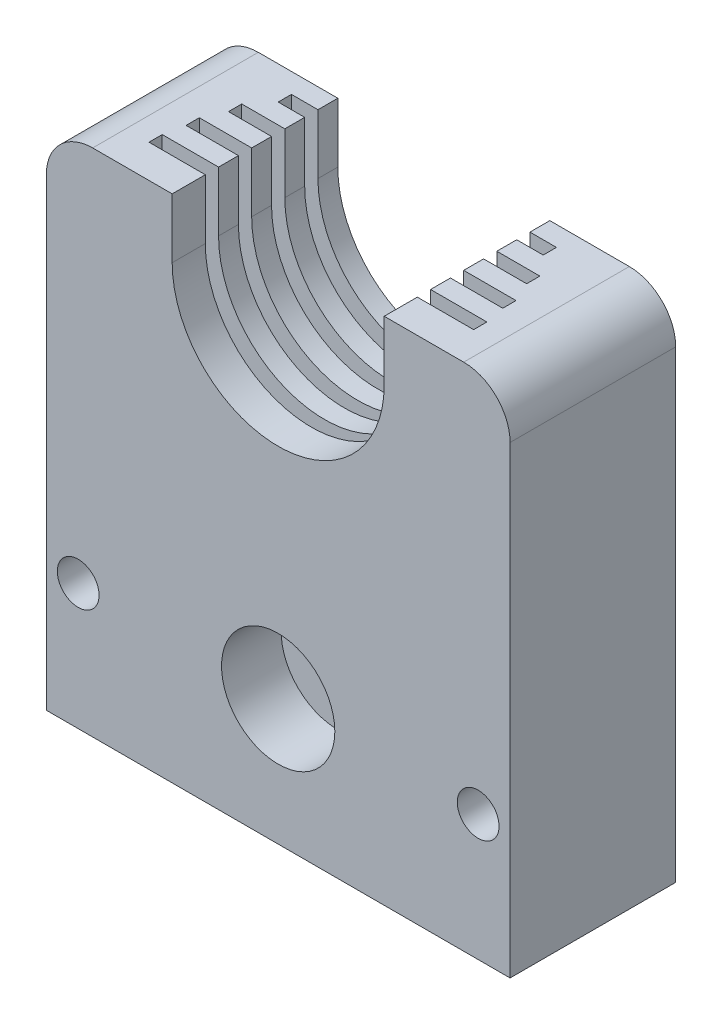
ISO-10303-21;
HEADER;
FILE_DESCRIPTION(('STEP AP214'),'2;1');
FILE_NAME('part.step','',(''),(''),'','','');
FILE_SCHEMA(('AUTOMOTIVE_DESIGN { 1 0 10303 214 1 1 1 1 }'));
ENDSEC;
DATA;
#1=APPLICATION_CONTEXT('core data for automotive mechanical design processes');
#2=APPLICATION_PROTOCOL_DEFINITION('international standard','automotive_design',2000,#1);
#3=PRODUCT_CONTEXT('',#1,'mechanical');
#4=PRODUCT('Part','Part','',(#3));
#5=PRODUCT_RELATED_PRODUCT_CATEGORY('part','',(#4));
#6=PRODUCT_DEFINITION_FORMATION('','',#4);
#7=PRODUCT_DEFINITION_CONTEXT('part definition',#1,'design');
#8=PRODUCT_DEFINITION('design','',#6,#7);
#9=PRODUCT_DEFINITION_SHAPE('','',#8);
#10=(LENGTH_UNIT() NAMED_UNIT(*) SI_UNIT(.MILLI.,.METRE.));
#11=(NAMED_UNIT(*) PLANE_ANGLE_UNIT() SI_UNIT($,.RADIAN.));
#12=(NAMED_UNIT(*) SI_UNIT($,.STERADIAN.) SOLID_ANGLE_UNIT());
#13=UNCERTAINTY_MEASURE_WITH_UNIT(LENGTH_MEASURE(1.E-05),#10,'distance_accuracy_value','');
#14=(GEOMETRIC_REPRESENTATION_CONTEXT(3) GLOBAL_UNCERTAINTY_ASSIGNED_CONTEXT((#13)) GLOBAL_UNIT_ASSIGNED_CONTEXT((#10,
#11,#12)) REPRESENTATION_CONTEXT('',''));
#15=CARTESIAN_POINT('',(0.,0.,0.));
#16=DIRECTION('',(0.,0.,1.));
#17=DIRECTION('',(1.,0.,0.));
#18=AXIS2_PLACEMENT_3D('',#15,#16,#17);
#19=CARTESIAN_POINT('',(0.,70.,25.));
#20=DIRECTION('',(0.,-1.,0.));
#21=DIRECTION('',(0.,0.,-1.));
#22=AXIS2_PLACEMENT_3D('',#19,#20,#21);
#23=PLANE('',#22);
#24=DIRECTION('',(0.,0.,-1.));
#25=VECTOR('',#24,1.);
#26=CARTESIAN_POINT('',(59.5,70.,0.));
#27=LINE('',#26,#25);
#28=CARTESIAN_POINT('',(59.5,70.,20.));
#29=VERTEX_POINT('',#28);
#30=CARTESIAN_POINT('',(59.5,70.,18.));
#31=VERTEX_POINT('',#30);
#32=EDGE_CURVE('E363',#29,#31,#27,.T.);
#33=ORIENTED_EDGE('',*,*,#32,.F.);
#34=DIRECTION('',(1.,0.,0.));
#35=VECTOR('',#34,1.);
#36=CARTESIAN_POINT('',(0.,70.,20.));
#37=LINE('',#36,#35);
#38=CARTESIAN_POINT('',(51.,70.,20.));
#39=VERTEX_POINT('',#38);
#40=EDGE_CURVE('E336',#39,#29,#37,.T.);
#41=ORIENTED_EDGE('',*,*,#40,.F.);
#42=DIRECTION('',(0.,0.,-1.));
#43=VECTOR('',#42,1.);
#44=CARTESIAN_POINT('',(51.,70.,152.628611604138));
#45=LINE('',#44,#43);
#46=CARTESIAN_POINT('',(51.,70.,25.));
#47=VERTEX_POINT('',#46);
#48=EDGE_CURVE('E554',#47,#39,#45,.T.);
#49=ORIENTED_EDGE('',*,*,#48,.F.);
#50=DIRECTION('',(-1.,0.,0.));
#51=VECTOR('',#50,1.);
#52=CARTESIAN_POINT('',(0.,70.,25.));
#53=LINE('',#52,#51);
#54=CARTESIAN_POINT('',(63.,70.,25.));
#55=VERTEX_POINT('',#54);
#56=EDGE_CURVE('E572',#55,#47,#53,.T.);
#57=ORIENTED_EDGE('',*,*,#56,.F.);
#58=DIRECTION('',(0.,0.,-1.));
#59=VECTOR('',#58,1.);
#60=CARTESIAN_POINT('',(63.,70.,25.));
#61=LINE('',#60,#59);
#62=CARTESIAN_POINT('',(63.,70.,0.));
#63=VERTEX_POINT('',#62);
#64=EDGE_CURVE('E575',#55,#63,#61,.T.);
#65=ORIENTED_EDGE('',*,*,#64,.T.);
#66=DIRECTION('',(-1.,0.,0.));
#67=VECTOR('',#66,1.);
#68=CARTESIAN_POINT('',(0.,70.,0.));
#69=LINE('',#68,#67);
#70=CARTESIAN_POINT('',(51.,70.,0.));
#71=VERTEX_POINT('',#70);
#72=EDGE_CURVE('E568',#63,#71,#69,.T.);
#73=ORIENTED_EDGE('',*,*,#72,.T.);
#74=CARTESIAN_POINT('',(51.,70.,3.));
#75=VERTEX_POINT('',#74);
#76=EDGE_CURVE('E552',#75,#71,#45,.T.);
#77=ORIENTED_EDGE('',*,*,#76,.F.);
#78=DIRECTION('',(1.,0.,0.));
#79=VECTOR('',#78,1.);
#80=CARTESIAN_POINT('',(15.,70.,3.));
#81=LINE('',#80,#79);
#82=CARTESIAN_POINT('',(55.,70.,3.));
#83=VERTEX_POINT('',#82);
#84=EDGE_CURVE('E454',#75,#83,#81,.T.);
#85=ORIENTED_EDGE('',*,*,#84,.T.);
#86=DIRECTION('',(0.,0.,-1.));
#87=VECTOR('',#86,1.);
#88=CARTESIAN_POINT('',(55.,70.,5.));
#89=LINE('',#88,#87);
#90=CARTESIAN_POINT('',(55.,70.,5.));
#91=VERTEX_POINT('',#90);
#92=EDGE_CURVE('E450',#91,#83,#89,.T.);
#93=ORIENTED_EDGE('',*,*,#92,.F.);
#94=DIRECTION('',(1.,0.,0.));
#95=VECTOR('',#94,1.);
#96=CARTESIAN_POINT('',(15.,70.,5.));
#97=LINE('',#96,#95);
#98=CARTESIAN_POINT('',(51.,70.,5.));
#99=VERTEX_POINT('',#98);
#100=EDGE_CURVE('E451',#99,#91,#97,.T.);
#101=ORIENTED_EDGE('',*,*,#100,.F.);
#102=CARTESIAN_POINT('',(51.,70.,8.));
#103=VERTEX_POINT('',#102);
#104=EDGE_CURVE('E729',#103,#99,#45,.T.);
#105=ORIENTED_EDGE('',*,*,#104,.F.);
#106=DIRECTION('',(1.,0.,0.));
#107=VECTOR('',#106,1.);
#108=CARTESIAN_POINT('',(0.,70.,8.));
#109=LINE('',#108,#107);
#110=CARTESIAN_POINT('',(57.5,70.,8.));
#111=VERTEX_POINT('',#110);
#112=EDGE_CURVE('E420',#103,#111,#109,.T.);
#113=ORIENTED_EDGE('',*,*,#112,.T.);
#114=DIRECTION('',(0.,0.,-1.));
#115=VECTOR('',#114,1.);
#116=CARTESIAN_POINT('',(57.5,70.,0.));
#117=LINE('',#116,#115);
#118=CARTESIAN_POINT('',(57.5,70.,10.));
#119=VERTEX_POINT('',#118);
#120=EDGE_CURVE('E425',#119,#111,#117,.T.);
#121=ORIENTED_EDGE('',*,*,#120,.F.);
#122=DIRECTION('',(1.,0.,0.));
#123=VECTOR('',#122,1.);
#124=CARTESIAN_POINT('',(0.,70.,10.));
#125=LINE('',#124,#123);
#126=CARTESIAN_POINT('',(51.,70.,10.));
#127=VERTEX_POINT('',#126);
#128=EDGE_CURVE('E428',#127,#119,#125,.T.);
#129=ORIENTED_EDGE('',*,*,#128,.F.);
#130=CARTESIAN_POINT('',(51.,70.,13.));
#131=VERTEX_POINT('',#130);
#132=EDGE_CURVE('E829',#131,#127,#45,.T.);
#133=ORIENTED_EDGE('',*,*,#132,.F.);
#134=DIRECTION('',(1.,0.,0.));
#135=VECTOR('',#134,1.);
#136=CARTESIAN_POINT('',(0.,70.,13.));
#137=LINE('',#136,#135);
#138=CARTESIAN_POINT('',(58.9,70.,13.));
#139=VERTEX_POINT('',#138);
#140=EDGE_CURVE('E394',#131,#139,#137,.T.);
#141=ORIENTED_EDGE('',*,*,#140,.T.);
#142=DIRECTION('',(0.,0.,-1.));
#143=VECTOR('',#142,1.);
#144=CARTESIAN_POINT('',(58.9,70.,0.));
#145=LINE('',#144,#143);
#146=CARTESIAN_POINT('',(58.9,70.,15.));
#147=VERTEX_POINT('',#146);
#148=EDGE_CURVE('E385',#147,#139,#145,.T.);
#149=ORIENTED_EDGE('',*,*,#148,.F.);
#150=DIRECTION('',(1.,0.,0.));
#151=VECTOR('',#150,1.);
#152=CARTESIAN_POINT('',(0.,70.,15.));
#153=LINE('',#152,#151);
#154=CARTESIAN_POINT('',(51.,70.,15.));
#155=VERTEX_POINT('',#154);
#156=EDGE_CURVE('E388',#155,#147,#153,.T.);
#157=ORIENTED_EDGE('',*,*,#156,.F.);
#158=CARTESIAN_POINT('',(51.,70.,18.));
#159=VERTEX_POINT('',#158);
#160=EDGE_CURVE('E558',#159,#155,#45,.T.);
#161=ORIENTED_EDGE('',*,*,#160,.F.);
#162=DIRECTION('',(1.,0.,0.));
#163=VECTOR('',#162,1.);
#164=CARTESIAN_POINT('',(0.,70.,18.));
#165=LINE('',#164,#163);
#166=EDGE_CURVE('E365',#159,#31,#165,.T.);
#167=ORIENTED_EDGE('',*,*,#166,.T.);
#168=EDGE_LOOP('',(#33,#41,#49,#57,#65,#73,#77,#85,#93,#101,#105,#113,#121,#129,#133,#141,#149,
#157,#161,#167));
#169=FACE_BOUND('',#168,.T.);
#170=ADVANCED_FACE('F62',(#169),#23,.F.);
#171=DIRECTION('',(0.,0.,-1.));
#172=VECTOR('',#171,1.);
#173=CARTESIAN_POINT('',(19.,70.,152.628611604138));
#174=LINE('',#173,#172);
#175=CARTESIAN_POINT('',(19.,70.,25.));
#176=VERTEX_POINT('',#175);
#177=CARTESIAN_POINT('',(19.,70.,20.));
#178=VERTEX_POINT('',#177);
#179=EDGE_CURVE('E539',#176,#178,#174,.T.);
#180=ORIENTED_EDGE('',*,*,#179,.T.);
#181=CARTESIAN_POINT('',(10.5,70.,20.));
#182=VERTEX_POINT('',#181);
#183=EDGE_CURVE('E361',#182,#178,#37,.T.);
#184=ORIENTED_EDGE('',*,*,#183,.F.);
#185=DIRECTION('',(0.,0.,-1.));
#186=VECTOR('',#185,1.);
#187=CARTESIAN_POINT('',(10.5,70.,0.));
#188=LINE('',#187,#186);
#189=CARTESIAN_POINT('',(10.5,70.,18.));
#190=VERTEX_POINT('',#189);
#191=EDGE_CURVE('E353',#182,#190,#188,.T.);
#192=ORIENTED_EDGE('',*,*,#191,.T.);
#193=CARTESIAN_POINT('',(19.,70.,18.));
#194=VERTEX_POINT('',#193);
#195=EDGE_CURVE('E356',#190,#194,#165,.T.);
#196=ORIENTED_EDGE('',*,*,#195,.T.);
#197=CARTESIAN_POINT('',(19.,70.,15.));
#198=VERTEX_POINT('',#197);
#199=EDGE_CURVE('E543',#194,#198,#174,.T.);
#200=ORIENTED_EDGE('',*,*,#199,.T.);
#201=CARTESIAN_POINT('',(11.1,70.,15.));
#202=VERTEX_POINT('',#201);
#203=EDGE_CURVE('E85',#202,#198,#153,.T.);
#204=ORIENTED_EDGE('',*,*,#203,.F.);
#205=DIRECTION('',(0.,0.,-1.));
#206=VECTOR('',#205,1.);
#207=CARTESIAN_POINT('',(11.1,70.,0.));
#208=LINE('',#207,#206);
#209=CARTESIAN_POINT('',(11.1,70.,13.));
#210=VERTEX_POINT('',#209);
#211=EDGE_CURVE('E391',#202,#210,#208,.T.);
#212=ORIENTED_EDGE('',*,*,#211,.T.);
#213=CARTESIAN_POINT('',(19.,70.,13.));
#214=VERTEX_POINT('',#213);
#215=EDGE_CURVE('E395',#210,#214,#137,.T.);
#216=ORIENTED_EDGE('',*,*,#215,.T.);
#217=CARTESIAN_POINT('',(19.,70.,10.));
#218=VERTEX_POINT('',#217);
#219=EDGE_CURVE('E704',#214,#218,#174,.T.);
#220=ORIENTED_EDGE('',*,*,#219,.T.);
#221=CARTESIAN_POINT('',(12.5,70.,10.));
#222=VERTEX_POINT('',#221);
#223=EDGE_CURVE('E384',#222,#218,#125,.T.);
#224=ORIENTED_EDGE('',*,*,#223,.F.);
#225=DIRECTION('',(0.,0.,-1.));
#226=VECTOR('',#225,1.);
#227=CARTESIAN_POINT('',(12.5,70.,0.));
#228=LINE('',#227,#226);
#229=CARTESIAN_POINT('',(12.5,70.,8.));
#230=VERTEX_POINT('',#229);
#231=EDGE_CURVE('E417',#222,#230,#228,.T.);
#232=ORIENTED_EDGE('',*,*,#231,.T.);
#233=CARTESIAN_POINT('',(19.,70.,8.));
#234=VERTEX_POINT('',#233);
#235=EDGE_CURVE('E422',#230,#234,#109,.T.);
#236=ORIENTED_EDGE('',*,*,#235,.T.);
#237=CARTESIAN_POINT('',(19.,70.,5.));
#238=VERTEX_POINT('',#237);
#239=EDGE_CURVE('E705',#234,#238,#174,.T.);
#240=ORIENTED_EDGE('',*,*,#239,.T.);
#241=CARTESIAN_POINT('',(15.,70.,5.));
#242=VERTEX_POINT('',#241);
#243=EDGE_CURVE('E77',#242,#238,#97,.T.);
#244=ORIENTED_EDGE('',*,*,#243,.F.);
#245=DIRECTION('',(0.,0.,-1.));
#246=VECTOR('',#245,1.);
#247=CARTESIAN_POINT('',(15.,70.,5.));
#248=LINE('',#247,#246);
#249=CARTESIAN_POINT('',(15.,70.,3.));
#250=VERTEX_POINT('',#249);
#251=EDGE_CURVE('E416',#242,#250,#248,.T.);
#252=ORIENTED_EDGE('',*,*,#251,.T.);
#253=CARTESIAN_POINT('',(19.,70.,3.));
#254=VERTEX_POINT('',#253);
#255=EDGE_CURVE('E455',#250,#254,#81,.T.);
#256=ORIENTED_EDGE('',*,*,#255,.T.);
#257=CARTESIAN_POINT('',(19.,70.,0.));
#258=VERTEX_POINT('',#257);
#259=EDGE_CURVE('E530',#254,#258,#174,.T.);
#260=ORIENTED_EDGE('',*,*,#259,.T.);
#261=CARTESIAN_POINT('',(6.99999999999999,70.,0.));
#262=VERTEX_POINT('',#261);
#263=EDGE_CURVE('E580',#258,#262,#69,.T.);
#264=ORIENTED_EDGE('',*,*,#263,.T.);
#265=DIRECTION('',(0.,0.,-1.));
#266=VECTOR('',#265,1.);
#267=CARTESIAN_POINT('',(6.99999999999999,70.,25.));
#268=LINE('',#267,#266);
#269=CARTESIAN_POINT('',(6.99999999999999,70.,25.));
#270=VERTEX_POINT('',#269);
#271=EDGE_CURVE('E597',#262,#270,#268,.F.);
#272=ORIENTED_EDGE('',*,*,#271,.T.);
#273=EDGE_CURVE('E571',#176,#270,#53,.T.);
#274=ORIENTED_EDGE('',*,*,#273,.F.);
#275=EDGE_LOOP('',(#180,#184,#192,#196,#200,#204,#212,#216,#220,#224,#232,#236,#240,#244,#252,
#256,#260,#264,#272,#274));
#276=FACE_BOUND('',#275,.T.);
#277=ADVANCED_FACE('F703',(#276),#23,.F.);
#278=CARTESIAN_POINT('',(51.,70.,152.628611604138));
#279=DIRECTION('',(-1.,0.,0.));
#280=DIRECTION('',(0.,0.,1.));
#281=AXIS2_PLACEMENT_3D('',#278,#279,#280);
#282=PLANE('',#281);
#283=DIRECTION('',(0.,0.,-1.));
#284=VECTOR('',#283,1.);
#285=CARTESIAN_POINT('',(51.,61.,152.628611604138));
#286=LINE('',#285,#284);
#287=CARTESIAN_POINT('',(51.,61.,18.));
#288=VERTEX_POINT('',#287);
#289=CARTESIAN_POINT('',(51.,61.,15.));
#290=VERTEX_POINT('',#289);
#291=EDGE_CURVE('E553',#288,#290,#286,.T.);
#292=ORIENTED_EDGE('',*,*,#291,.F.);
#293=DIRECTION('',(0.,1.,0.));
#294=VECTOR('',#293,1.);
#295=CARTESIAN_POINT('',(51.,70.,18.));
#296=LINE('',#295,#294);
#297=EDGE_CURVE('E501',#288,#159,#296,.T.);
#298=ORIENTED_EDGE('',*,*,#297,.T.);
#299=ORIENTED_EDGE('',*,*,#160,.T.);
#300=DIRECTION('',(0.,1.,0.));
#301=VECTOR('',#300,1.);
#302=CARTESIAN_POINT('',(51.,70.,15.));
#303=LINE('',#302,#301);
#304=EDGE_CURVE('E490',#290,#155,#303,.T.);
#305=ORIENTED_EDGE('',*,*,#304,.F.);
#306=EDGE_LOOP('',(#292,#298,#299,#305));
#307=FACE_BOUND('',#306,.T.);
#308=ADVANCED_FACE('F674',(#307),#282,.T.);
#309=CARTESIAN_POINT('',(51.,61.,13.));
#310=VERTEX_POINT('',#309);
#311=CARTESIAN_POINT('',(51.,61.,10.));
#312=VERTEX_POINT('',#311);
#313=EDGE_CURVE('E664',#310,#312,#286,.T.);
#314=ORIENTED_EDGE('',*,*,#313,.F.);
#315=DIRECTION('',(0.,1.,0.));
#316=VECTOR('',#315,1.);
#317=CARTESIAN_POINT('',(51.,70.,13.));
#318=LINE('',#317,#316);
#319=EDGE_CURVE('E495',#310,#131,#318,.T.);
#320=ORIENTED_EDGE('',*,*,#319,.T.);
#321=ORIENTED_EDGE('',*,*,#132,.T.);
#322=DIRECTION('',(0.,1.,0.));
#323=VECTOR('',#322,1.);
#324=CARTESIAN_POINT('',(51.,70.,10.));
#325=LINE('',#324,#323);
#326=EDGE_CURVE('E486',#312,#127,#325,.T.);
#327=ORIENTED_EDGE('',*,*,#326,.F.);
#328=EDGE_LOOP('',(#314,#320,#321,#327));
#329=FACE_BOUND('',#328,.T.);
#330=ADVANCED_FACE('F810',(#329),#282,.T.);
#331=CARTESIAN_POINT('',(51.,61.,8.00000000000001));
#332=VERTEX_POINT('',#331);
#333=CARTESIAN_POINT('',(51.,61.,5.));
#334=VERTEX_POINT('',#333);
#335=EDGE_CURVE('E662',#332,#334,#286,.T.);
#336=ORIENTED_EDGE('',*,*,#335,.F.);
#337=DIRECTION('',(0.,1.,0.));
#338=VECTOR('',#337,1.);
#339=CARTESIAN_POINT('',(51.,70.,8.00000000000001));
#340=LINE('',#339,#338);
#341=EDGE_CURVE('E481',#332,#103,#340,.T.);
#342=ORIENTED_EDGE('',*,*,#341,.T.);
#343=ORIENTED_EDGE('',*,*,#104,.T.);
#344=DIRECTION('',(0.,1.,0.));
#345=VECTOR('',#344,1.);
#346=CARTESIAN_POINT('',(51.,70.,5.));
#347=LINE('',#346,#345);
#348=EDGE_CURVE('E470',#334,#99,#347,.T.);
#349=ORIENTED_EDGE('',*,*,#348,.F.);
#350=EDGE_LOOP('',(#336,#342,#343,#349));
#351=FACE_BOUND('',#350,.T.);
#352=ADVANCED_FACE('F812',(#351),#282,.T.);
#353=CARTESIAN_POINT('',(51.,61.,3.));
#354=VERTEX_POINT('',#353);
#355=CARTESIAN_POINT('',(51.,61.,0.));
#356=VERTEX_POINT('',#355);
#357=EDGE_CURVE('E547',#354,#356,#286,.T.);
#358=ORIENTED_EDGE('',*,*,#357,.F.);
#359=DIRECTION('',(0.,1.,0.));
#360=VECTOR('',#359,1.);
#361=CARTESIAN_POINT('',(51.,70.,3.));
#362=LINE('',#361,#360);
#363=EDGE_CURVE('E475',#354,#75,#362,.T.);
#364=ORIENTED_EDGE('',*,*,#363,.T.);
#365=ORIENTED_EDGE('',*,*,#76,.T.);
#366=DIRECTION('',(0.,-1.,0.));
#367=VECTOR('',#366,1.);
#368=CARTESIAN_POINT('',(51.,0.,0.));
#369=LINE('',#368,#367);
#370=EDGE_CURVE('E608',#71,#356,#369,.T.);
#371=ORIENTED_EDGE('',*,*,#370,.T.);
#372=EDGE_LOOP('',(#358,#364,#365,#371));
#373=FACE_BOUND('',#372,.T.);
#374=ADVANCED_FACE('F728',(#373),#282,.T.);
#375=CARTESIAN_POINT('',(35.,61.,152.628611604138));
#376=DIRECTION('',(0.,0.,-1.));
#377=DIRECTION('',(-1.,0.,0.));
#378=AXIS2_PLACEMENT_3D('',#375,#376,#377);
#379=CYLINDRICAL_SURFACE('',#378,16.);
#380=DIRECTION('',(0.,0.,-1.));
#381=VECTOR('',#380,1.);
#382=CARTESIAN_POINT('',(19.,61.,152.628611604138));
#383=LINE('',#382,#381);
#384=CARTESIAN_POINT('',(19.,61.,18.));
#385=VERTEX_POINT('',#384);
#386=CARTESIAN_POINT('',(19.,61.,15.));
#387=VERTEX_POINT('',#386);
#388=EDGE_CURVE('E548',#385,#387,#383,.T.);
#389=ORIENTED_EDGE('',*,*,#388,.F.);
#390=CARTESIAN_POINT('',(35.,61.,18.));
#391=DIRECTION('',(0.,0.,1.));
#392=DIRECTION('',(1.,0.,0.));
#393=AXIS2_PLACEMENT_3D('',#390,#391,#392);
#394=CIRCLE('',#393,16.);
#395=EDGE_CURVE('E498',#385,#288,#394,.T.);
#396=ORIENTED_EDGE('',*,*,#395,.T.);
#397=ORIENTED_EDGE('',*,*,#291,.T.);
#398=CARTESIAN_POINT('',(35.,61.,15.));
#399=DIRECTION('',(0.,0.,1.));
#400=DIRECTION('',(1.,0.,0.));
#401=AXIS2_PLACEMENT_3D('',#398,#399,#400);
#402=CIRCLE('',#401,16.);
#403=EDGE_CURVE('E488',#387,#290,#402,.T.);
#404=ORIENTED_EDGE('',*,*,#403,.F.);
#405=EDGE_LOOP('',(#389,#396,#397,#404));
#406=FACE_BOUND('',#405,.T.);
#407=ADVANCED_FACE('F636',(#406),#379,.F.);
#408=CARTESIAN_POINT('',(19.,61.,13.));
#409=VERTEX_POINT('',#408);
#410=CARTESIAN_POINT('',(19.,61.,10.));
#411=VERTEX_POINT('',#410);
#412=EDGE_CURVE('E639',#409,#411,#383,.T.);
#413=ORIENTED_EDGE('',*,*,#412,.F.);
#414=CARTESIAN_POINT('',(35.,61.,13.));
#415=DIRECTION('',(0.,0.,1.));
#416=DIRECTION('',(1.,0.,0.));
#417=AXIS2_PLACEMENT_3D('',#414,#415,#416);
#418=CIRCLE('',#417,16.);
#419=EDGE_CURVE('E492',#409,#310,#418,.T.);
#420=ORIENTED_EDGE('',*,*,#419,.T.);
#421=ORIENTED_EDGE('',*,*,#313,.T.);
#422=CARTESIAN_POINT('',(35.,61.,10.));
#423=DIRECTION('',(0.,0.,1.));
#424=DIRECTION('',(1.,0.,0.));
#425=AXIS2_PLACEMENT_3D('',#422,#423,#424);
#426=CIRCLE('',#425,16.);
#427=EDGE_CURVE('E484',#411,#312,#426,.T.);
#428=ORIENTED_EDGE('',*,*,#427,.F.);
#429=EDGE_LOOP('',(#413,#420,#421,#428));
#430=FACE_BOUND('',#429,.T.);
#431=ADVANCED_FACE('F817',(#430),#379,.F.);
#432=CARTESIAN_POINT('',(19.,61.,8.00000000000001));
#433=VERTEX_POINT('',#432);
#434=CARTESIAN_POINT('',(19.,61.,5.));
#435=VERTEX_POINT('',#434);
#436=EDGE_CURVE('E641',#433,#435,#383,.T.);
#437=ORIENTED_EDGE('',*,*,#436,.F.);
#438=CARTESIAN_POINT('',(35.,61.,8.00000000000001));
#439=DIRECTION('',(0.,0.,1.));
#440=DIRECTION('',(1.,0.,0.));
#441=AXIS2_PLACEMENT_3D('',#438,#439,#440);
#442=CIRCLE('',#441,16.);
#443=EDGE_CURVE('E478',#433,#332,#442,.T.);
#444=ORIENTED_EDGE('',*,*,#443,.T.);
#445=ORIENTED_EDGE('',*,*,#335,.T.);
#446=CARTESIAN_POINT('',(35.,61.,5.));
#447=DIRECTION('',(0.,0.,1.));
#448=DIRECTION('',(1.,0.,0.));
#449=AXIS2_PLACEMENT_3D('',#446,#447,#448);
#450=CIRCLE('',#449,16.);
#451=EDGE_CURVE('E370',#435,#334,#450,.T.);
#452=ORIENTED_EDGE('',*,*,#451,.F.);
#453=EDGE_LOOP('',(#437,#444,#445,#452));
#454=FACE_BOUND('',#453,.T.);
#455=ADVANCED_FACE('F851',(#454),#379,.F.);
#456=CARTESIAN_POINT('',(19.,61.,3.));
#457=VERTEX_POINT('',#456);
#458=CARTESIAN_POINT('',(19.,61.,0.));
#459=VERTEX_POINT('',#458);
#460=EDGE_CURVE('E542',#457,#459,#383,.T.);
#461=ORIENTED_EDGE('',*,*,#460,.F.);
#462=CARTESIAN_POINT('',(35.,61.,3.));
#463=DIRECTION('',(0.,0.,1.));
#464=DIRECTION('',(1.,0.,0.));
#465=AXIS2_PLACEMENT_3D('',#462,#463,#464);
#466=CIRCLE('',#465,16.);
#467=EDGE_CURVE('E472',#457,#354,#466,.T.);
#468=ORIENTED_EDGE('',*,*,#467,.T.);
#469=ORIENTED_EDGE('',*,*,#357,.T.);
#470=CARTESIAN_POINT('',(35.,61.,0.));
#471=DIRECTION('',(0.,0.,1.));
#472=DIRECTION('',(1.,0.,0.));
#473=AXIS2_PLACEMENT_3D('',#470,#471,#472);
#474=CIRCLE('',#473,16.);
#475=EDGE_CURVE('E605',#356,#459,#474,.F.);
#476=ORIENTED_EDGE('',*,*,#475,.T.);
#477=EDGE_LOOP('',(#461,#468,#469,#476));
#478=FACE_BOUND('',#477,.T.);
#479=ADVANCED_FACE('F659',(#478),#379,.F.);
#480=CARTESIAN_POINT('',(19.,70.,152.628611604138));
#481=DIRECTION('',(1.,0.,0.));
#482=DIRECTION('',(0.,0.,-1.));
#483=AXIS2_PLACEMENT_3D('',#480,#481,#482);
#484=PLANE('',#483);
#485=ORIENTED_EDGE('',*,*,#199,.F.);
#486=DIRECTION('',(0.,-1.,0.));
#487=VECTOR('',#486,1.);
#488=CARTESIAN_POINT('',(19.,70.,18.));
#489=LINE('',#488,#487);
#490=EDGE_CURVE('E70',#194,#385,#489,.T.);
#491=ORIENTED_EDGE('',*,*,#490,.T.);
#492=ORIENTED_EDGE('',*,*,#388,.T.);
#493=DIRECTION('',(0.,-1.,0.));
#494=VECTOR('',#493,1.);
#495=CARTESIAN_POINT('',(19.,70.,15.));
#496=LINE('',#495,#494);
#497=EDGE_CURVE('E621',#198,#387,#496,.T.);
#498=ORIENTED_EDGE('',*,*,#497,.F.);
#499=EDGE_LOOP('',(#485,#491,#492,#498));
#500=FACE_BOUND('',#499,.T.);
#501=ADVANCED_FACE('F630',(#500),#484,.T.);
#502=ORIENTED_EDGE('',*,*,#219,.F.);
#503=DIRECTION('',(0.,-1.,0.));
#504=VECTOR('',#503,1.);
#505=CARTESIAN_POINT('',(19.,70.,13.));
#506=LINE('',#505,#504);
#507=EDGE_CURVE('E623',#214,#409,#506,.T.);
#508=ORIENTED_EDGE('',*,*,#507,.T.);
#509=ORIENTED_EDGE('',*,*,#412,.T.);
#510=DIRECTION('',(0.,-1.,0.));
#511=VECTOR('',#510,1.);
#512=CARTESIAN_POINT('',(19.,70.,10.));
#513=LINE('',#512,#511);
#514=EDGE_CURVE('E619',#218,#411,#513,.T.);
#515=ORIENTED_EDGE('',*,*,#514,.F.);
#516=EDGE_LOOP('',(#502,#508,#509,#515));
#517=FACE_BOUND('',#516,.T.);
#518=ADVANCED_FACE('F905',(#517),#484,.T.);
#519=ORIENTED_EDGE('',*,*,#239,.F.);
#520=DIRECTION('',(0.,-1.,0.));
#521=VECTOR('',#520,1.);
#522=CARTESIAN_POINT('',(19.,70.,8.00000000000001));
#523=LINE('',#522,#521);
#524=EDGE_CURVE('E616',#234,#433,#523,.T.);
#525=ORIENTED_EDGE('',*,*,#524,.T.);
#526=ORIENTED_EDGE('',*,*,#436,.T.);
#527=DIRECTION('',(0.,-1.,0.));
#528=VECTOR('',#527,1.);
#529=CARTESIAN_POINT('',(19.,70.,5.));
#530=LINE('',#529,#528);
#531=EDGE_CURVE('E611',#238,#435,#530,.T.);
#532=ORIENTED_EDGE('',*,*,#531,.F.);
#533=EDGE_LOOP('',(#519,#525,#526,#532));
#534=FACE_BOUND('',#533,.T.);
#535=ADVANCED_FACE('F850',(#534),#484,.T.);
#536=ORIENTED_EDGE('',*,*,#259,.F.);
#537=DIRECTION('',(0.,-1.,0.));
#538=VECTOR('',#537,1.);
#539=CARTESIAN_POINT('',(19.,70.,3.));
#540=LINE('',#539,#538);
#541=EDGE_CURVE('E613',#254,#457,#540,.T.);
#542=ORIENTED_EDGE('',*,*,#541,.T.);
#543=ORIENTED_EDGE('',*,*,#460,.T.);
#544=DIRECTION('',(0.,1.,0.));
#545=VECTOR('',#544,1.);
#546=CARTESIAN_POINT('',(19.,0.,0.));
#547=LINE('',#546,#545);
#548=EDGE_CURVE('E602',#459,#258,#547,.T.);
#549=ORIENTED_EDGE('',*,*,#548,.T.);
#550=EDGE_LOOP('',(#536,#542,#543,#549));
#551=FACE_BOUND('',#550,.T.);
#552=ADVANCED_FACE('F652',(#551),#484,.T.);
#553=CARTESIAN_POINT('',(0.,0.,25.));
#554=DIRECTION('',(0.,0.,1.));
#555=DIRECTION('',(1.,0.,0.));
#556=AXIS2_PLACEMENT_3D('',#553,#554,#555);
#557=PLANE('',#556);
#558=CARTESIAN_POINT('',(35.,12.,25.));
#559=DIRECTION('',(0.,0.,1.));
#560=DIRECTION('',(1.,0.,0.));
#561=AXIS2_PLACEMENT_3D('',#558,#559,#560);
#562=CIRCLE('',#561,8.55);
#563=CARTESIAN_POINT('',(43.55,12.,25.));
#564=VERTEX_POINT('',#563);
#565=EDGE_CURVE('E520',#564,#564,#562,.T.);
#566=ORIENTED_EDGE('',*,*,#565,.F.);
#567=EDGE_LOOP('',(#566));
#568=FACE_BOUND('',#567,.T.);
#569=CARTESIAN_POINT('',(4.815,12.,25.));
#570=DIRECTION('',(0.,0.,1.));
#571=DIRECTION('',(1.,0.,0.));
#572=AXIS2_PLACEMENT_3D('',#569,#570,#571);
#573=CIRCLE('',#572,3.15);
#574=CARTESIAN_POINT('',(7.965,12.,25.));
#575=VERTEX_POINT('',#574);
#576=EDGE_CURVE('E531',#575,#575,#573,.T.);
#577=ORIENTED_EDGE('',*,*,#576,.F.);
#578=EDGE_LOOP('',(#577));
#579=FACE_BOUND('',#578,.T.);
#580=CARTESIAN_POINT('',(65.185,12.,25.));
#581=DIRECTION('',(0.,0.,1.));
#582=DIRECTION('',(1.,0.,0.));
#583=AXIS2_PLACEMENT_3D('',#580,#581,#582);
#584=CIRCLE('',#583,3.15);
#585=CARTESIAN_POINT('',(68.335,12.,25.));
#586=VERTEX_POINT('',#585);
#587=EDGE_CURVE('E524',#586,#586,#584,.T.);
#588=ORIENTED_EDGE('',*,*,#587,.F.);
#589=EDGE_LOOP('',(#588));
#590=FACE_BOUND('',#589,.T.);
#591=ORIENTED_EDGE('',*,*,#56,.T.);
#592=DIRECTION('',(0.,-1.,0.));
#593=VECTOR('',#592,1.);
#594=CARTESIAN_POINT('',(51.,0.,25.));
#595=LINE('',#594,#593);
#596=CARTESIAN_POINT('',(51.,61.,25.));
#597=VERTEX_POINT('',#596);
#598=EDGE_CURVE('E562',#47,#597,#595,.T.);
#599=ORIENTED_EDGE('',*,*,#598,.T.);
#600=CARTESIAN_POINT('',(35.,61.,25.));
#601=DIRECTION('',(0.,0.,1.));
#602=DIRECTION('',(1.,0.,0.));
#603=AXIS2_PLACEMENT_3D('',#600,#601,#602);
#604=CIRCLE('',#603,16.);
#605=CARTESIAN_POINT('',(19.,61.,25.));
#606=VERTEX_POINT('',#605);
#607=EDGE_CURVE('E560',#597,#606,#604,.F.);
#608=ORIENTED_EDGE('',*,*,#607,.T.);
#609=DIRECTION('',(0.,1.,0.));
#610=VECTOR('',#609,1.);
#611=CARTESIAN_POINT('',(19.,0.,25.));
#612=LINE('',#611,#610);
#613=EDGE_CURVE('E557',#606,#176,#612,.T.);
#614=ORIENTED_EDGE('',*,*,#613,.T.);
#615=ORIENTED_EDGE('',*,*,#273,.T.);
#616=CARTESIAN_POINT('',(6.99999999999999,63.,25.));
#617=DIRECTION('',(0.,0.,1.));
#618=DIRECTION('',(1.,0.,0.));
#619=AXIS2_PLACEMENT_3D('',#616,#617,#618);
#620=CIRCLE('',#619,7.);
#621=CARTESIAN_POINT('',(0.,63.,25.));
#622=VERTEX_POINT('',#621);
#623=EDGE_CURVE('E600',#270,#622,#620,.T.);
#624=ORIENTED_EDGE('',*,*,#623,.T.);
#625=DIRECTION('',(0.,-1.,0.));
#626=VECTOR('',#625,1.);
#627=CARTESIAN_POINT('',(0.,70.,25.));
#628=LINE('',#627,#626);
#629=CARTESIAN_POINT('',(0.,-7.,25.));
#630=VERTEX_POINT('',#629);
#631=EDGE_CURVE('E565',#622,#630,#628,.T.);
#632=ORIENTED_EDGE('',*,*,#631,.T.);
#633=DIRECTION('',(-1.,0.,0.));
#634=VECTOR('',#633,1.);
#635=CARTESIAN_POINT('',(0.,-7.,25.));
#636=LINE('',#635,#634);
#637=CARTESIAN_POINT('',(70.,-7.,25.));
#638=VERTEX_POINT('',#637);
#639=EDGE_CURVE('E517',#638,#630,#636,.T.);
#640=ORIENTED_EDGE('',*,*,#639,.F.);
#641=DIRECTION('',(0.,1.,0.));
#642=VECTOR('',#641,1.);
#643=CARTESIAN_POINT('',(70.,70.,25.));
#644=LINE('',#643,#642);
#645=CARTESIAN_POINT('',(70.,63.,25.));
#646=VERTEX_POINT('',#645);
#647=EDGE_CURVE('E567',#638,#646,#644,.T.);
#648=ORIENTED_EDGE('',*,*,#647,.T.);
#649=CARTESIAN_POINT('',(63.,63.,25.));
#650=DIRECTION('',(0.,0.,1.));
#651=DIRECTION('',(1.,0.,0.));
#652=AXIS2_PLACEMENT_3D('',#649,#650,#651);
#653=CIRCLE('',#652,7.);
#654=EDGE_CURVE('E589',#646,#55,#653,.T.);
#655=ORIENTED_EDGE('',*,*,#654,.T.);
#656=EDGE_LOOP('',(#591,#599,#608,#614,#615,#624,#632,#640,#648,#655));
#657=FACE_BOUND('',#656,.T.);
#658=ADVANCED_FACE('F746',(#568,#579,#590,#657),#557,.T.);
#659=CARTESIAN_POINT('',(0.,0.,0.));
#660=DIRECTION('',(0.,0.,1.));
#661=DIRECTION('',(1.,0.,0.));
#662=AXIS2_PLACEMENT_3D('',#659,#660,#661);
#663=PLANE('',#662);
#664=ORIENTED_EDGE('',*,*,#370,.F.);
#665=ORIENTED_EDGE('',*,*,#72,.F.);
#666=CARTESIAN_POINT('',(63.,63.,0.));
#667=DIRECTION('',(0.,0.,1.));
#668=DIRECTION('',(1.,0.,0.));
#669=AXIS2_PLACEMENT_3D('',#666,#667,#668);
#670=CIRCLE('',#669,7.);
#671=CARTESIAN_POINT('',(70.,63.,0.));
#672=VERTEX_POINT('',#671);
#673=EDGE_CURVE('E585',#63,#672,#670,.F.);
#674=ORIENTED_EDGE('',*,*,#673,.T.);
#675=DIRECTION('',(0.,1.,0.));
#676=VECTOR('',#675,1.);
#677=CARTESIAN_POINT('',(70.,70.,0.));
#678=LINE('',#677,#676);
#679=CARTESIAN_POINT('',(70.,-7.,0.));
#680=VERTEX_POINT('',#679);
#681=EDGE_CURVE('E577',#680,#672,#678,.T.);
#682=ORIENTED_EDGE('',*,*,#681,.F.);
#683=DIRECTION('',(1.,0.,0.));
#684=VECTOR('',#683,1.);
#685=CARTESIAN_POINT('',(0.,-7.,0.));
#686=LINE('',#685,#684);
#687=CARTESIAN_POINT('',(0.,-7.,0.));
#688=VERTEX_POINT('',#687);
#689=EDGE_CURVE('E511',#688,#680,#686,.T.);
#690=ORIENTED_EDGE('',*,*,#689,.F.);
#691=DIRECTION('',(0.,-1.,0.));
#692=VECTOR('',#691,1.);
#693=CARTESIAN_POINT('',(0.,70.,0.));
#694=LINE('',#693,#692);
#695=CARTESIAN_POINT('',(0.,63.,0.));
#696=VERTEX_POINT('',#695);
#697=EDGE_CURVE('E564',#696,#688,#694,.T.);
#698=ORIENTED_EDGE('',*,*,#697,.F.);
#699=CARTESIAN_POINT('',(6.99999999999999,63.,0.));
#700=DIRECTION('',(0.,0.,1.));
#701=DIRECTION('',(1.,0.,0.));
#702=AXIS2_PLACEMENT_3D('',#699,#700,#701);
#703=CIRCLE('',#702,7.);
#704=EDGE_CURVE('E594',#696,#262,#703,.F.);
#705=ORIENTED_EDGE('',*,*,#704,.T.);
#706=ORIENTED_EDGE('',*,*,#263,.F.);
#707=ORIENTED_EDGE('',*,*,#548,.F.);
#708=ORIENTED_EDGE('',*,*,#475,.F.);
#709=EDGE_LOOP('',(#664,#665,#674,#682,#690,#698,#705,#706,#707,#708));
#710=FACE_BOUND('',#709,.T.);
#711=ADVANCED_FACE('F658',(#710),#663,.F.);
#712=CARTESIAN_POINT('',(0.,70.,25.));
#713=DIRECTION('',(1.,0.,0.));
#714=DIRECTION('',(0.,1.,0.));
#715=AXIS2_PLACEMENT_3D('',#712,#713,#714);
#716=PLANE('',#715);
#717=ORIENTED_EDGE('',*,*,#631,.F.);
#718=DIRECTION('',(0.,0.,-1.));
#719=VECTOR('',#718,1.);
#720=CARTESIAN_POINT('',(0.,63.,25.));
#721=LINE('',#720,#719);
#722=EDGE_CURVE('E591',#622,#696,#721,.T.);
#723=ORIENTED_EDGE('',*,*,#722,.T.);
#724=ORIENTED_EDGE('',*,*,#697,.T.);
#725=DIRECTION('',(0.,0.,-1.));
#726=VECTOR('',#725,1.);
#727=CARTESIAN_POINT('',(0.,-7.,25.));
#728=LINE('',#727,#726);
#729=EDGE_CURVE('E508',#630,#688,#728,.T.);
#730=ORIENTED_EDGE('',*,*,#729,.F.);
#731=EDGE_LOOP('',(#717,#723,#724,#730));
#732=FACE_BOUND('',#731,.T.);
#733=ADVANCED_FACE('F751',(#732),#716,.F.);
#734=CARTESIAN_POINT('',(70.,70.,25.));
#735=DIRECTION('',(-1.,0.,0.));
#736=DIRECTION('',(0.,-1.,0.));
#737=AXIS2_PLACEMENT_3D('',#734,#735,#736);
#738=PLANE('',#737);
#739=ORIENTED_EDGE('',*,*,#681,.T.);
#740=DIRECTION('',(0.,0.,-1.));
#741=VECTOR('',#740,1.);
#742=CARTESIAN_POINT('',(70.,63.,25.));
#743=LINE('',#742,#741);
#744=EDGE_CURVE('E587',#672,#646,#743,.F.);
#745=ORIENTED_EDGE('',*,*,#744,.T.);
#746=ORIENTED_EDGE('',*,*,#647,.F.);
#747=DIRECTION('',(0.,0.,1.));
#748=VECTOR('',#747,1.);
#749=CARTESIAN_POINT('',(70.,-7.,25.));
#750=LINE('',#749,#748);
#751=EDGE_CURVE('E514',#680,#638,#750,.T.);
#752=ORIENTED_EDGE('',*,*,#751,.F.);
#753=EDGE_LOOP('',(#739,#745,#746,#752));
#754=FACE_BOUND('',#753,.T.);
#755=ADVANCED_FACE('F740',(#754),#738,.F.);
#756=CARTESIAN_POINT('',(63.,63.,25.));
#757=DIRECTION('',(0.,0.,-1.));
#758=DIRECTION('',(-1.,0.,0.));
#759=AXIS2_PLACEMENT_3D('',#756,#757,#758);
#760=CYLINDRICAL_SURFACE('',#759,7.);
#761=ORIENTED_EDGE('',*,*,#654,.F.);
#762=ORIENTED_EDGE('',*,*,#744,.F.);
#763=ORIENTED_EDGE('',*,*,#673,.F.);
#764=ORIENTED_EDGE('',*,*,#64,.F.);
#765=EDGE_LOOP('',(#761,#762,#763,#764));
#766=FACE_BOUND('',#765,.T.);
#767=ADVANCED_FACE('F735',(#766),#760,.T.);
#768=CARTESIAN_POINT('',(6.99999999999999,63.,25.));
#769=DIRECTION('',(0.,0.,-1.));
#770=DIRECTION('',(-1.,0.,0.));
#771=AXIS2_PLACEMENT_3D('',#768,#769,#770);
#772=CYLINDRICAL_SURFACE('',#771,7.);
#773=ORIENTED_EDGE('',*,*,#623,.F.);
#774=ORIENTED_EDGE('',*,*,#271,.F.);
#775=ORIENTED_EDGE('',*,*,#704,.F.);
#776=ORIENTED_EDGE('',*,*,#722,.F.);
#777=EDGE_LOOP('',(#773,#774,#775,#776));
#778=FACE_BOUND('',#777,.T.);
#779=ADVANCED_FACE('F64',(#778),#772,.T.);
#780=DIRECTION('',(0.,1.,0.));
#781=VECTOR('',#780,1.);
#782=CARTESIAN_POINT('',(51.,70.,20.));
#783=LINE('',#782,#781);
#784=CARTESIAN_POINT('',(51.,61.,20.));
#785=VERTEX_POINT('',#784);
#786=EDGE_CURVE('E506',#785,#39,#783,.T.);
#787=ORIENTED_EDGE('',*,*,#786,.F.);
#788=EDGE_CURVE('E549',#597,#785,#286,.T.);
#789=ORIENTED_EDGE('',*,*,#788,.F.);
#790=ORIENTED_EDGE('',*,*,#598,.F.);
#791=ORIENTED_EDGE('',*,*,#48,.T.);
#792=EDGE_LOOP('',(#787,#789,#790,#791));
#793=FACE_BOUND('',#792,.T.);
#794=ADVANCED_FACE('F771',(#793),#282,.T.);
#795=CARTESIAN_POINT('',(35.,61.,20.));
#796=DIRECTION('',(0.,0.,1.));
#797=DIRECTION('',(1.,0.,0.));
#798=AXIS2_PLACEMENT_3D('',#795,#796,#797);
#799=CIRCLE('',#798,16.);
#800=CARTESIAN_POINT('',(19.,61.,20.));
#801=VERTEX_POINT('',#800);
#802=EDGE_CURVE('E504',#801,#785,#799,.T.);
#803=ORIENTED_EDGE('',*,*,#802,.F.);
#804=EDGE_CURVE('E544',#606,#801,#383,.T.);
#805=ORIENTED_EDGE('',*,*,#804,.F.);
#806=ORIENTED_EDGE('',*,*,#607,.F.);
#807=ORIENTED_EDGE('',*,*,#788,.T.);
#808=EDGE_LOOP('',(#803,#805,#806,#807));
#809=FACE_BOUND('',#808,.T.);
#810=ADVANCED_FACE('F766',(#809),#379,.F.);
#811=DIRECTION('',(0.,-1.,0.));
#812=VECTOR('',#811,1.);
#813=CARTESIAN_POINT('',(19.,70.,20.));
#814=LINE('',#813,#812);
#815=EDGE_CURVE('E12',#178,#801,#814,.T.);
#816=ORIENTED_EDGE('',*,*,#815,.F.);
#817=ORIENTED_EDGE('',*,*,#179,.F.);
#818=ORIENTED_EDGE('',*,*,#613,.F.);
#819=ORIENTED_EDGE('',*,*,#804,.T.);
#820=EDGE_LOOP('',(#816,#817,#818,#819));
#821=FACE_BOUND('',#820,.T.);
#822=ADVANCED_FACE('F761',(#821),#484,.T.);
#823=CARTESIAN_POINT('',(65.185,12.,5.));
#824=DIRECTION('',(0.,0.,1.));
#825=DIRECTION('',(1.,0.,0.));
#826=AXIS2_PLACEMENT_3D('',#823,#824,#825);
#827=CYLINDRICAL_SURFACE('',#826,3.15);
#828=CARTESIAN_POINT('',(65.185,12.,5.));
#829=DIRECTION('',(0.,0.,1.));
#830=DIRECTION('',(1.,0.,0.));
#831=AXIS2_PLACEMENT_3D('',#828,#829,#830);
#832=CIRCLE('',#831,3.15);
#833=CARTESIAN_POINT('',(68.335,12.,5.));
#834=VERTEX_POINT('',#833);
#835=EDGE_CURVE('E534',#834,#834,#832,.T.);
#836=ORIENTED_EDGE('',*,*,#835,.F.);
#837=EDGE_LOOP('',(#836));
#838=FACE_BOUND('',#837,.T.);
#839=ORIENTED_EDGE('',*,*,#587,.T.);
#840=EDGE_LOOP('',(#839));
#841=FACE_BOUND('',#840,.T.);
#842=ADVANCED_FACE('F896',(#838,#841),#827,.F.);
#843=CARTESIAN_POINT('',(65.185,12.,5.));
#844=DIRECTION('',(0.,0.,1.));
#845=DIRECTION('',(1.,0.,0.));
#846=AXIS2_PLACEMENT_3D('',#843,#844,#845);
#847=PLANE('',#846);
#848=ORIENTED_EDGE('',*,*,#835,.T.);
#849=EDGE_LOOP('',(#848));
#850=FACE_BOUND('',#849,.T.);
#851=ADVANCED_FACE('F892',(#850),#847,.T.);
#852=CARTESIAN_POINT('',(4.815,12.,5.));
#853=DIRECTION('',(0.,0.,1.));
#854=DIRECTION('',(1.,0.,0.));
#855=AXIS2_PLACEMENT_3D('',#852,#853,#854);
#856=CYLINDRICAL_SURFACE('',#855,3.15);
#857=CARTESIAN_POINT('',(4.815,12.,5.));
#858=DIRECTION('',(0.,0.,1.));
#859=DIRECTION('',(1.,0.,0.));
#860=AXIS2_PLACEMENT_3D('',#857,#858,#859);
#861=CIRCLE('',#860,3.15);
#862=CARTESIAN_POINT('',(7.965,12.,5.));
#863=VERTEX_POINT('',#862);
#864=EDGE_CURVE('E527',#863,#863,#861,.T.);
#865=ORIENTED_EDGE('',*,*,#864,.F.);
#866=EDGE_LOOP('',(#865));
#867=FACE_BOUND('',#866,.T.);
#868=ORIENTED_EDGE('',*,*,#576,.T.);
#869=EDGE_LOOP('',(#868));
#870=FACE_BOUND('',#869,.T.);
#871=ADVANCED_FACE('F888',(#867,#870),#856,.F.);
#872=CARTESIAN_POINT('',(4.815,12.,5.));
#873=DIRECTION('',(0.,0.,1.));
#874=DIRECTION('',(1.,0.,0.));
#875=AXIS2_PLACEMENT_3D('',#872,#873,#874);
#876=PLANE('',#875);
#877=ORIENTED_EDGE('',*,*,#864,.T.);
#878=EDGE_LOOP('',(#877));
#879=FACE_BOUND('',#878,.T.);
#880=ADVANCED_FACE('F884',(#879),#876,.T.);
#881=CARTESIAN_POINT('',(35.,12.,16.));
#882=DIRECTION('',(0.,0.,1.));
#883=DIRECTION('',(1.,0.,0.));
#884=AXIS2_PLACEMENT_3D('',#881,#882,#883);
#885=CYLINDRICAL_SURFACE('',#884,8.55);
#886=CARTESIAN_POINT('',(35.,12.,16.));
#887=DIRECTION('',(0.,0.,1.));
#888=DIRECTION('',(1.,0.,0.));
#889=AXIS2_PLACEMENT_3D('',#886,#887,#888);
#890=CIRCLE('',#889,8.55);
#891=CARTESIAN_POINT('',(43.55,12.,16.));
#892=VERTEX_POINT('',#891);
#893=EDGE_CURVE('E521',#892,#892,#890,.T.);
#894=ORIENTED_EDGE('',*,*,#893,.F.);
#895=EDGE_LOOP('',(#894));
#896=FACE_BOUND('',#895,.T.);
#897=ORIENTED_EDGE('',*,*,#565,.T.);
#898=EDGE_LOOP('',(#897));
#899=FACE_BOUND('',#898,.T.);
#900=ADVANCED_FACE('F880',(#896,#899),#885,.F.);
#901=CARTESIAN_POINT('',(35.,12.,16.));
#902=DIRECTION('',(0.,0.,1.));
#903=DIRECTION('',(1.,0.,0.));
#904=AXIS2_PLACEMENT_3D('',#901,#902,#903);
#905=PLANE('',#904);
#906=ORIENTED_EDGE('',*,*,#893,.T.);
#907=EDGE_LOOP('',(#906));
#908=FACE_BOUND('',#907,.T.);
#909=ADVANCED_FACE('F877',(#908),#905,.T.);
#910=CARTESIAN_POINT('',(0.,-7.,0.));
#911=DIRECTION('',(0.,-1.,0.));
#912=DIRECTION('',(0.,0.,-1.));
#913=AXIS2_PLACEMENT_3D('',#910,#911,#912);
#914=PLANE('',#913);
#915=ORIENTED_EDGE('',*,*,#729,.T.);
#916=ORIENTED_EDGE('',*,*,#689,.T.);
#917=ORIENTED_EDGE('',*,*,#751,.T.);
#918=ORIENTED_EDGE('',*,*,#639,.T.);
#919=EDGE_LOOP('',(#915,#916,#917,#918));
#920=FACE_BOUND('',#919,.T.);
#921=ADVANCED_FACE('F743',(#920),#914,.T.);
#922=CARTESIAN_POINT('',(0.,43.,3.));
#923=DIRECTION('',(0.,0.,1.));
#924=DIRECTION('',(1.,0.,0.));
#925=AXIS2_PLACEMENT_3D('',#922,#923,#924);
#926=PLANE('',#925);
#927=ORIENTED_EDGE('',*,*,#467,.F.);
#928=ORIENTED_EDGE('',*,*,#541,.F.);
#929=ORIENTED_EDGE('',*,*,#255,.F.);
#930=DIRECTION('',(0.,1.,0.));
#931=VECTOR('',#930,1.);
#932=CARTESIAN_POINT('',(15.,43.,3.));
#933=LINE('',#932,#931);
#934=CARTESIAN_POINT('',(15.,43.,3.));
#935=VERTEX_POINT('',#934);
#936=EDGE_CURVE('E438',#935,#250,#933,.T.);
#937=ORIENTED_EDGE('',*,*,#936,.F.);
#938=DIRECTION('',(1.,0.,0.));
#939=VECTOR('',#938,1.);
#940=CARTESIAN_POINT('',(15.,43.,3.));
#941=LINE('',#940,#939);
#942=CARTESIAN_POINT('',(55.,43.,3.));
#943=VERTEX_POINT('',#942);
#944=EDGE_CURVE('E464',#935,#943,#941,.T.);
#945=ORIENTED_EDGE('',*,*,#944,.T.);
#946=DIRECTION('',(0.,1.,0.));
#947=VECTOR('',#946,1.);
#948=CARTESIAN_POINT('',(55.,43.,3.));
#949=LINE('',#948,#947);
#950=EDGE_CURVE('E441',#943,#83,#949,.T.);
#951=ORIENTED_EDGE('',*,*,#950,.T.);
#952=ORIENTED_EDGE('',*,*,#84,.F.);
#953=ORIENTED_EDGE('',*,*,#363,.F.);
#954=EDGE_LOOP('',(#927,#928,#929,#937,#945,#951,#952,#953));
#955=FACE_BOUND('',#954,.T.);
#956=ADVANCED_FACE('F712',(#955),#926,.T.);
#957=CARTESIAN_POINT('',(0.,43.,5.));
#958=DIRECTION('',(0.,0.,1.));
#959=DIRECTION('',(1.,0.,0.));
#960=AXIS2_PLACEMENT_3D('',#957,#958,#959);
#961=PLANE('',#960);
#962=ORIENTED_EDGE('',*,*,#348,.T.);
#963=ORIENTED_EDGE('',*,*,#100,.T.);
#964=DIRECTION('',(0.,1.,0.));
#965=VECTOR('',#964,1.);
#966=CARTESIAN_POINT('',(55.,43.,5.));
#967=LINE('',#966,#965);
#968=CARTESIAN_POINT('',(55.,43.,5.));
#969=VERTEX_POINT('',#968);
#970=EDGE_CURVE('E443',#969,#91,#967,.T.);
#971=ORIENTED_EDGE('',*,*,#970,.F.);
#972=DIRECTION('',(1.,0.,0.));
#973=VECTOR('',#972,1.);
#974=CARTESIAN_POINT('',(15.,43.,5.));
#975=LINE('',#974,#973);
#976=CARTESIAN_POINT('',(15.,43.,5.));
#977=VERTEX_POINT('',#976);
#978=EDGE_CURVE('E448',#977,#969,#975,.T.);
#979=ORIENTED_EDGE('',*,*,#978,.F.);
#980=DIRECTION('',(0.,1.,0.));
#981=VECTOR('',#980,1.);
#982=CARTESIAN_POINT('',(15.,43.,5.));
#983=LINE('',#982,#981);
#984=EDGE_CURVE('E446',#977,#242,#983,.T.);
#985=ORIENTED_EDGE('',*,*,#984,.T.);
#986=ORIENTED_EDGE('',*,*,#243,.T.);
#987=ORIENTED_EDGE('',*,*,#531,.T.);
#988=ORIENTED_EDGE('',*,*,#451,.T.);
#989=EDGE_LOOP('',(#962,#963,#971,#979,#985,#986,#987,#988));
#990=FACE_BOUND('',#989,.T.);
#991=ADVANCED_FACE('F826',(#990),#961,.F.);
#992=CARTESIAN_POINT('',(0.,43.,0.));
#993=DIRECTION('',(0.,1.,0.));
#994=DIRECTION('',(0.,0.,1.));
#995=AXIS2_PLACEMENT_3D('',#992,#993,#994);
#996=PLANE('',#995);
#997=DIRECTION('',(0.,0.,-1.));
#998=VECTOR('',#997,1.);
#999=CARTESIAN_POINT('',(15.,43.,5.));
#1000=LINE('',#999,#998);
#1001=EDGE_CURVE('E466',#977,#935,#1000,.T.);
#1002=ORIENTED_EDGE('',*,*,#1001,.F.);
#1003=ORIENTED_EDGE('',*,*,#978,.T.);
#1004=DIRECTION('',(0.,0.,-1.));
#1005=VECTOR('',#1004,1.);
#1006=CARTESIAN_POINT('',(55.,43.,5.));
#1007=LINE('',#1006,#1005);
#1008=EDGE_CURVE('E461',#969,#943,#1007,.T.);
#1009=ORIENTED_EDGE('',*,*,#1008,.T.);
#1010=ORIENTED_EDGE('',*,*,#944,.F.);
#1011=EDGE_LOOP('',(#1002,#1003,#1009,#1010));
#1012=FACE_BOUND('',#1011,.T.);
#1013=ADVANCED_FACE('F718',(#1012),#996,.T.);
#1014=CARTESIAN_POINT('',(55.,43.,5.));
#1015=DIRECTION('',(1.,0.,0.));
#1016=DIRECTION('',(0.,0.,-1.));
#1017=AXIS2_PLACEMENT_3D('',#1014,#1015,#1016);
#1018=PLANE('',#1017);
#1019=ORIENTED_EDGE('',*,*,#92,.T.);
#1020=ORIENTED_EDGE('',*,*,#950,.F.);
#1021=ORIENTED_EDGE('',*,*,#1008,.F.);
#1022=ORIENTED_EDGE('',*,*,#970,.T.);
#1023=EDGE_LOOP('',(#1019,#1020,#1021,#1022));
#1024=FACE_BOUND('',#1023,.T.);
#1025=ADVANCED_FACE('F723',(#1024),#1018,.F.);
#1026=CARTESIAN_POINT('',(15.,43.,5.));
#1027=DIRECTION('',(1.,0.,0.));
#1028=DIRECTION('',(0.,0.,-1.));
#1029=AXIS2_PLACEMENT_3D('',#1026,#1027,#1028);
#1030=PLANE('',#1029);
#1031=ORIENTED_EDGE('',*,*,#251,.F.);
#1032=ORIENTED_EDGE('',*,*,#984,.F.);
#1033=ORIENTED_EDGE('',*,*,#1001,.T.);
#1034=ORIENTED_EDGE('',*,*,#936,.T.);
#1035=EDGE_LOOP('',(#1031,#1032,#1033,#1034));
#1036=FACE_BOUND('',#1035,.T.);
#1037=ADVANCED_FACE('F714',(#1036),#1030,.T.);
#1038=CARTESIAN_POINT('',(0.,43.,10.));
#1039=DIRECTION('',(0.,0.,1.));
#1040=DIRECTION('',(1.,0.,0.));
#1041=AXIS2_PLACEMENT_3D('',#1038,#1039,#1040);
#1042=PLANE('',#1041);
#1043=ORIENTED_EDGE('',*,*,#326,.T.);
#1044=ORIENTED_EDGE('',*,*,#128,.T.);
#1045=DIRECTION('',(0.,1.,0.));
#1046=VECTOR('',#1045,1.);
#1047=CARTESIAN_POINT('',(57.5,43.,10.));
#1048=LINE('',#1047,#1046);
#1049=CARTESIAN_POINT('',(57.5,43.,10.));
#1050=VERTEX_POINT('',#1049);
#1051=EDGE_CURVE('E406',#1050,#119,#1048,.T.);
#1052=ORIENTED_EDGE('',*,*,#1051,.F.);
#1053=DIRECTION('',(1.,0.,0.));
#1054=VECTOR('',#1053,1.);
#1055=CARTESIAN_POINT('',(0.,43.,10.));
#1056=LINE('',#1055,#1054);
#1057=CARTESIAN_POINT('',(12.5,43.,10.));
#1058=VERTEX_POINT('',#1057);
#1059=EDGE_CURVE('E421',#1058,#1050,#1056,.T.);
#1060=ORIENTED_EDGE('',*,*,#1059,.F.);
#1061=DIRECTION('',(0.,1.,0.));
#1062=VECTOR('',#1061,1.);
#1063=CARTESIAN_POINT('',(12.5,43.,10.));
#1064=LINE('',#1063,#1062);
#1065=EDGE_CURVE('E414',#1058,#222,#1064,.T.);
#1066=ORIENTED_EDGE('',*,*,#1065,.T.);
#1067=ORIENTED_EDGE('',*,*,#223,.T.);
#1068=ORIENTED_EDGE('',*,*,#514,.T.);
#1069=ORIENTED_EDGE('',*,*,#427,.T.);
#1070=EDGE_LOOP('',(#1043,#1044,#1052,#1060,#1066,#1067,#1068,#1069));
#1071=FACE_BOUND('',#1070,.T.);
#1072=ADVANCED_FACE('F834',(#1071),#1042,.F.);
#1073=CARTESIAN_POINT('',(12.5,43.,0.));
#1074=DIRECTION('',(1.,0.,0.));
#1075=DIRECTION('',(0.,0.,-1.));
#1076=AXIS2_PLACEMENT_3D('',#1073,#1074,#1075);
#1077=PLANE('',#1076);
#1078=ORIENTED_EDGE('',*,*,#231,.F.);
#1079=ORIENTED_EDGE('',*,*,#1065,.F.);
#1080=DIRECTION('',(0.,0.,-1.));
#1081=VECTOR('',#1080,1.);
#1082=CARTESIAN_POINT('',(12.5,43.,0.));
#1083=LINE('',#1082,#1081);
#1084=CARTESIAN_POINT('',(12.5,43.,8.));
#1085=VERTEX_POINT('',#1084);
#1086=EDGE_CURVE('E409',#1058,#1085,#1083,.T.);
#1087=ORIENTED_EDGE('',*,*,#1086,.T.);
#1088=DIRECTION('',(0.,1.,0.));
#1089=VECTOR('',#1088,1.);
#1090=CARTESIAN_POINT('',(12.5,43.,8.));
#1091=LINE('',#1090,#1089);
#1092=EDGE_CURVE('E412',#1085,#230,#1091,.T.);
#1093=ORIENTED_EDGE('',*,*,#1092,.T.);
#1094=EDGE_LOOP('',(#1078,#1079,#1087,#1093));
#1095=FACE_BOUND('',#1094,.T.);
#1096=ADVANCED_FACE('F846',(#1095),#1077,.T.);
#1097=CARTESIAN_POINT('',(0.,43.,8.));
#1098=DIRECTION('',(0.,0.,1.));
#1099=DIRECTION('',(1.,0.,0.));
#1100=AXIS2_PLACEMENT_3D('',#1097,#1098,#1099);
#1101=PLANE('',#1100);
#1102=ORIENTED_EDGE('',*,*,#443,.F.);
#1103=ORIENTED_EDGE('',*,*,#524,.F.);
#1104=ORIENTED_EDGE('',*,*,#235,.F.);
#1105=ORIENTED_EDGE('',*,*,#1092,.F.);
#1106=DIRECTION('',(1.,0.,0.));
#1107=VECTOR('',#1106,1.);
#1108=CARTESIAN_POINT('',(0.,43.,8.));
#1109=LINE('',#1108,#1107);
#1110=CARTESIAN_POINT('',(57.5,43.,8.));
#1111=VERTEX_POINT('',#1110);
#1112=EDGE_CURVE('E431',#1085,#1111,#1109,.T.);
#1113=ORIENTED_EDGE('',*,*,#1112,.T.);
#1114=DIRECTION('',(0.,1.,0.));
#1115=VECTOR('',#1114,1.);
#1116=CARTESIAN_POINT('',(57.5,43.,8.));
#1117=LINE('',#1116,#1115);
#1118=EDGE_CURVE('E410',#1111,#111,#1117,.T.);
#1119=ORIENTED_EDGE('',*,*,#1118,.T.);
#1120=ORIENTED_EDGE('',*,*,#112,.F.);
#1121=ORIENTED_EDGE('',*,*,#341,.F.);
#1122=EDGE_LOOP('',(#1102,#1103,#1104,#1105,#1113,#1119,#1120,#1121));
#1123=FACE_BOUND('',#1122,.T.);
#1124=ADVANCED_FACE('F852',(#1123),#1101,.T.);
#1125=CARTESIAN_POINT('',(57.5,43.,0.));
#1126=DIRECTION('',(1.,0.,0.));
#1127=DIRECTION('',(0.,0.,-1.));
#1128=AXIS2_PLACEMENT_3D('',#1125,#1126,#1127);
#1129=PLANE('',#1128);
#1130=ORIENTED_EDGE('',*,*,#120,.T.);
#1131=ORIENTED_EDGE('',*,*,#1118,.F.);
#1132=DIRECTION('',(0.,0.,-1.));
#1133=VECTOR('',#1132,1.);
#1134=CARTESIAN_POINT('',(57.5,43.,0.));
#1135=LINE('',#1134,#1133);
#1136=EDGE_CURVE('E433',#1050,#1111,#1135,.T.);
#1137=ORIENTED_EDGE('',*,*,#1136,.F.);
#1138=ORIENTED_EDGE('',*,*,#1051,.T.);
#1139=EDGE_LOOP('',(#1130,#1131,#1137,#1138));
#1140=FACE_BOUND('',#1139,.T.);
#1141=ADVANCED_FACE('F838',(#1140),#1129,.F.);
#1142=CARTESIAN_POINT('',(0.,43.,0.));
#1143=DIRECTION('',(0.,1.,0.));
#1144=DIRECTION('',(0.,0.,1.));
#1145=AXIS2_PLACEMENT_3D('',#1142,#1143,#1144);
#1146=PLANE('',#1145);
#1147=ORIENTED_EDGE('',*,*,#1059,.T.);
#1148=ORIENTED_EDGE('',*,*,#1136,.T.);
#1149=ORIENTED_EDGE('',*,*,#1112,.F.);
#1150=ORIENTED_EDGE('',*,*,#1086,.F.);
#1151=EDGE_LOOP('',(#1147,#1148,#1149,#1150));
#1152=FACE_BOUND('',#1151,.T.);
#1153=ADVANCED_FACE('F843',(#1152),#1146,.T.);
#1154=CARTESIAN_POINT('',(0.,43.,13.));
#1155=DIRECTION('',(0.,0.,1.));
#1156=DIRECTION('',(1.,0.,0.));
#1157=AXIS2_PLACEMENT_3D('',#1154,#1155,#1156);
#1158=PLANE('',#1157);
#1159=ORIENTED_EDGE('',*,*,#419,.F.);
#1160=ORIENTED_EDGE('',*,*,#507,.F.);
#1161=ORIENTED_EDGE('',*,*,#215,.F.);
#1162=DIRECTION('',(0.,1.,0.));
#1163=VECTOR('',#1162,1.);
#1164=CARTESIAN_POINT('',(11.1,43.,13.));
#1165=LINE('',#1164,#1163);
#1166=CARTESIAN_POINT('',(11.1,43.,13.));
#1167=VERTEX_POINT('',#1166);
#1168=EDGE_CURVE('E374',#1167,#210,#1165,.T.);
#1169=ORIENTED_EDGE('',*,*,#1168,.F.);
#1170=DIRECTION('',(1.,0.,0.));
#1171=VECTOR('',#1170,1.);
#1172=CARTESIAN_POINT('',(0.,43.,13.));
#1173=LINE('',#1172,#1171);
#1174=CARTESIAN_POINT('',(58.9,43.,13.));
#1175=VERTEX_POINT('',#1174);
#1176=EDGE_CURVE('E389',#1167,#1175,#1173,.T.);
#1177=ORIENTED_EDGE('',*,*,#1176,.T.);
#1178=DIRECTION('',(0.,1.,0.));
#1179=VECTOR('',#1178,1.);
#1180=CARTESIAN_POINT('',(58.9,43.,13.));
#1181=LINE('',#1180,#1179);
#1182=EDGE_CURVE('E382',#1175,#139,#1181,.T.);
#1183=ORIENTED_EDGE('',*,*,#1182,.T.);
#1184=ORIENTED_EDGE('',*,*,#140,.F.);
#1185=ORIENTED_EDGE('',*,*,#319,.F.);
#1186=EDGE_LOOP('',(#1159,#1160,#1161,#1169,#1177,#1183,#1184,#1185));
#1187=FACE_BOUND('',#1186,.T.);
#1188=ADVANCED_FACE('F699',(#1187),#1158,.T.);
#1189=CARTESIAN_POINT('',(58.9,43.,0.));
#1190=DIRECTION('',(1.,0.,0.));
#1191=DIRECTION('',(0.,0.,-1.));
#1192=AXIS2_PLACEMENT_3D('',#1189,#1190,#1191);
#1193=PLANE('',#1192);
#1194=ORIENTED_EDGE('',*,*,#148,.T.);
#1195=ORIENTED_EDGE('',*,*,#1182,.F.);
#1196=DIRECTION('',(0.,0.,-1.));
#1197=VECTOR('',#1196,1.);
#1198=CARTESIAN_POINT('',(58.9,43.,0.));
#1199=LINE('',#1198,#1197);
#1200=CARTESIAN_POINT('',(58.9,43.,15.));
#1201=VERTEX_POINT('',#1200);
#1202=EDGE_CURVE('E376',#1201,#1175,#1199,.T.);
#1203=ORIENTED_EDGE('',*,*,#1202,.F.);
#1204=DIRECTION('',(0.,1.,0.));
#1205=VECTOR('',#1204,1.);
#1206=CARTESIAN_POINT('',(58.9,43.,15.));
#1207=LINE('',#1206,#1205);
#1208=EDGE_CURVE('E379',#1201,#147,#1207,.T.);
#1209=ORIENTED_EDGE('',*,*,#1208,.T.);
#1210=EDGE_LOOP('',(#1194,#1195,#1203,#1209));
#1211=FACE_BOUND('',#1210,.T.);
#1212=ADVANCED_FACE('F686',(#1211),#1193,.F.);
#1213=CARTESIAN_POINT('',(0.,43.,15.));
#1214=DIRECTION('',(0.,0.,1.));
#1215=DIRECTION('',(1.,0.,0.));
#1216=AXIS2_PLACEMENT_3D('',#1213,#1214,#1215);
#1217=PLANE('',#1216);
#1218=ORIENTED_EDGE('',*,*,#304,.T.);
#1219=ORIENTED_EDGE('',*,*,#156,.T.);
#1220=ORIENTED_EDGE('',*,*,#1208,.F.);
#1221=DIRECTION('',(1.,0.,0.));
#1222=VECTOR('',#1221,1.);
#1223=CARTESIAN_POINT('',(0.,43.,15.));
#1224=LINE('',#1223,#1222);
#1225=CARTESIAN_POINT('',(11.1,43.,15.));
#1226=VERTEX_POINT('',#1225);
#1227=EDGE_CURVE('E400',#1226,#1201,#1224,.T.);
#1228=ORIENTED_EDGE('',*,*,#1227,.F.);
#1229=DIRECTION('',(0.,1.,0.));
#1230=VECTOR('',#1229,1.);
#1231=CARTESIAN_POINT('',(11.1,43.,15.));
#1232=LINE('',#1231,#1230);
#1233=EDGE_CURVE('E377',#1226,#202,#1232,.T.);
#1234=ORIENTED_EDGE('',*,*,#1233,.T.);
#1235=ORIENTED_EDGE('',*,*,#203,.T.);
#1236=ORIENTED_EDGE('',*,*,#497,.T.);
#1237=ORIENTED_EDGE('',*,*,#403,.T.);
#1238=EDGE_LOOP('',(#1218,#1219,#1220,#1228,#1234,#1235,#1236,#1237));
#1239=FACE_BOUND('',#1238,.T.);
#1240=ADVANCED_FACE('F678',(#1239),#1217,.F.);
#1241=CARTESIAN_POINT('',(11.1,43.,0.));
#1242=DIRECTION('',(1.,0.,0.));
#1243=DIRECTION('',(0.,0.,-1.));
#1244=AXIS2_PLACEMENT_3D('',#1241,#1242,#1243);
#1245=PLANE('',#1244);
#1246=ORIENTED_EDGE('',*,*,#211,.F.);
#1247=ORIENTED_EDGE('',*,*,#1233,.F.);
#1248=DIRECTION('',(0.,0.,-1.));
#1249=VECTOR('',#1248,1.);
#1250=CARTESIAN_POINT('',(11.1,43.,0.));
#1251=LINE('',#1250,#1249);
#1252=EDGE_CURVE('E403',#1226,#1167,#1251,.T.);
#1253=ORIENTED_EDGE('',*,*,#1252,.T.);
#1254=ORIENTED_EDGE('',*,*,#1168,.T.);
#1255=EDGE_LOOP('',(#1246,#1247,#1253,#1254));
#1256=FACE_BOUND('',#1255,.T.);
#1257=ADVANCED_FACE('F696',(#1256),#1245,.T.);
#1258=CARTESIAN_POINT('',(0.,43.,0.));
#1259=DIRECTION('',(0.,1.,0.));
#1260=DIRECTION('',(0.,0.,1.));
#1261=AXIS2_PLACEMENT_3D('',#1258,#1259,#1260);
#1262=PLANE('',#1261);
#1263=ORIENTED_EDGE('',*,*,#1176,.F.);
#1264=ORIENTED_EDGE('',*,*,#1252,.F.);
#1265=ORIENTED_EDGE('',*,*,#1227,.T.);
#1266=ORIENTED_EDGE('',*,*,#1202,.T.);
#1267=EDGE_LOOP('',(#1263,#1264,#1265,#1266));
#1268=FACE_BOUND('',#1267,.T.);
#1269=ADVANCED_FACE('F692',(#1268),#1262,.T.);
#1270=CARTESIAN_POINT('',(0.,43.,20.));
#1271=DIRECTION('',(0.,0.,1.));
#1272=DIRECTION('',(1.,0.,0.));
#1273=AXIS2_PLACEMENT_3D('',#1270,#1271,#1272);
#1274=PLANE('',#1273);
#1275=ORIENTED_EDGE('',*,*,#786,.T.);
#1276=ORIENTED_EDGE('',*,*,#40,.T.);
#1277=DIRECTION('',(0.,1.,0.));
#1278=VECTOR('',#1277,1.);
#1279=CARTESIAN_POINT('',(59.5,43.,20.));
#1280=LINE('',#1279,#1278);
#1281=CARTESIAN_POINT('',(59.5,43.,20.));
#1282=VERTEX_POINT('',#1281);
#1283=EDGE_CURVE('E330',#1282,#29,#1280,.T.);
#1284=ORIENTED_EDGE('',*,*,#1283,.F.);
#1285=DIRECTION('',(1.,0.,0.));
#1286=VECTOR('',#1285,1.);
#1287=CARTESIAN_POINT('',(0.,43.,20.));
#1288=LINE('',#1287,#1286);
#1289=CARTESIAN_POINT('',(10.5,43.,20.));
#1290=VERTEX_POINT('',#1289);
#1291=EDGE_CURVE('E334',#1290,#1282,#1288,.T.);
#1292=ORIENTED_EDGE('',*,*,#1291,.F.);
#1293=DIRECTION('',(0.,1.,0.));
#1294=VECTOR('',#1293,1.);
#1295=CARTESIAN_POINT('',(10.5,43.,20.));
#1296=LINE('',#1295,#1294);
#1297=EDGE_CURVE('E368',#1290,#182,#1296,.T.);
#1298=ORIENTED_EDGE('',*,*,#1297,.T.);
#1299=ORIENTED_EDGE('',*,*,#183,.T.);
#1300=ORIENTED_EDGE('',*,*,#815,.T.);
#1301=ORIENTED_EDGE('',*,*,#802,.T.);
#1302=EDGE_LOOP('',(#1275,#1276,#1284,#1292,#1298,#1299,#1300,#1301));
#1303=FACE_BOUND('',#1302,.T.);
#1304=ADVANCED_FACE('F332',(#1303),#1274,.F.);
#1305=CARTESIAN_POINT('',(10.5,43.,0.));
#1306=DIRECTION('',(1.,0.,0.));
#1307=DIRECTION('',(0.,0.,-1.));
#1308=AXIS2_PLACEMENT_3D('',#1305,#1306,#1307);
#1309=PLANE('',#1308);
#1310=ORIENTED_EDGE('',*,*,#191,.F.);
#1311=ORIENTED_EDGE('',*,*,#1297,.F.);
#1312=DIRECTION('',(0.,0.,-1.));
#1313=VECTOR('',#1312,1.);
#1314=CARTESIAN_POINT('',(10.5,43.,0.));
#1315=LINE('',#1314,#1313);
#1316=CARTESIAN_POINT('',(10.5,43.,18.));
#1317=VERTEX_POINT('',#1316);
#1318=EDGE_CURVE('E341',#1290,#1317,#1315,.T.);
#1319=ORIENTED_EDGE('',*,*,#1318,.T.);
#1320=DIRECTION('',(0.,1.,0.));
#1321=VECTOR('',#1320,1.);
#1322=CARTESIAN_POINT('',(10.5,43.,18.));
#1323=LINE('',#1322,#1321);
#1324=EDGE_CURVE('E371',#1317,#190,#1323,.T.);
#1325=ORIENTED_EDGE('',*,*,#1324,.T.);
#1326=EDGE_LOOP('',(#1310,#1311,#1319,#1325));
#1327=FACE_BOUND('',#1326,.T.);
#1328=ADVANCED_FACE('F776',(#1327),#1309,.T.);
#1329=CARTESIAN_POINT('',(0.,43.,18.));
#1330=DIRECTION('',(0.,0.,1.));
#1331=DIRECTION('',(1.,0.,0.));
#1332=AXIS2_PLACEMENT_3D('',#1329,#1330,#1331);
#1333=PLANE('',#1332);
#1334=ORIENTED_EDGE('',*,*,#395,.F.);
#1335=ORIENTED_EDGE('',*,*,#490,.F.);
#1336=ORIENTED_EDGE('',*,*,#195,.F.);
#1337=ORIENTED_EDGE('',*,*,#1324,.F.);
#1338=DIRECTION('',(1.,0.,0.));
#1339=VECTOR('',#1338,1.);
#1340=CARTESIAN_POINT('',(0.,43.,18.));
#1341=LINE('',#1340,#1339);
#1342=CARTESIAN_POINT('',(59.5,43.,18.));
#1343=VERTEX_POINT('',#1342);
#1344=EDGE_CURVE('E349',#1317,#1343,#1341,.T.);
#1345=ORIENTED_EDGE('',*,*,#1344,.T.);
#1346=DIRECTION('',(0.,1.,0.));
#1347=VECTOR('',#1346,1.);
#1348=CARTESIAN_POINT('',(59.5,43.,18.));
#1349=LINE('',#1348,#1347);
#1350=EDGE_CURVE('E340',#1343,#31,#1349,.T.);
#1351=ORIENTED_EDGE('',*,*,#1350,.T.);
#1352=ORIENTED_EDGE('',*,*,#166,.F.);
#1353=ORIENTED_EDGE('',*,*,#297,.F.);
#1354=EDGE_LOOP('',(#1334,#1335,#1336,#1337,#1345,#1351,#1352,#1353));
#1355=FACE_BOUND('',#1354,.T.);
#1356=ADVANCED_FACE('F772',(#1355),#1333,.T.);
#1357=CARTESIAN_POINT('',(59.5,43.,0.));
#1358=DIRECTION('',(1.,0.,0.));
#1359=DIRECTION('',(0.,0.,-1.));
#1360=AXIS2_PLACEMENT_3D('',#1357,#1358,#1359);
#1361=PLANE('',#1360);
#1362=ORIENTED_EDGE('',*,*,#32,.T.);
#1363=ORIENTED_EDGE('',*,*,#1350,.F.);
#1364=DIRECTION('',(0.,0.,-1.));
#1365=VECTOR('',#1364,1.);
#1366=CARTESIAN_POINT('',(59.5,43.,0.));
#1367=LINE('',#1366,#1365);
#1368=EDGE_CURVE('E345',#1282,#1343,#1367,.T.);
#1369=ORIENTED_EDGE('',*,*,#1368,.F.);
#1370=ORIENTED_EDGE('',*,*,#1283,.T.);
#1371=EDGE_LOOP('',(#1362,#1363,#1369,#1370));
#1372=FACE_BOUND('',#1371,.T.);
#1373=ADVANCED_FACE('F346',(#1372),#1361,.F.);
#1374=CARTESIAN_POINT('',(0.,43.,0.));
#1375=DIRECTION('',(0.,1.,0.));
#1376=DIRECTION('',(0.,0.,1.));
#1377=AXIS2_PLACEMENT_3D('',#1374,#1375,#1376);
#1378=PLANE('',#1377);
#1379=ORIENTED_EDGE('',*,*,#1291,.T.);
#1380=ORIENTED_EDGE('',*,*,#1368,.T.);
#1381=ORIENTED_EDGE('',*,*,#1344,.F.);
#1382=ORIENTED_EDGE('',*,*,#1318,.F.);
#1383=EDGE_LOOP('',(#1379,#1380,#1381,#1382));
#1384=FACE_BOUND('',#1383,.T.);
#1385=ADVANCED_FACE('F352',(#1384),#1378,.T.);
#1386=CLOSED_SHELL('',(#170,#277,#308,#330,#352,#374,#407,#431,#455,#479,#501,#518,#535,#552,
#658,#711,#733,#755,#767,#779,#794,#810,#822,#842,#851,#871,#880,#900,#909,#921,#956,#991,#1013,
#1025,#1037,#1072,#1096,#1124,#1141,#1153,#1188,#1212,#1240,#1257,#1269,#1304,#1328,#1356,#1373,#1385));
#1387=MANIFOLD_SOLID_BREP('B2',#1386);
#1388=ADVANCED_BREP_SHAPE_REPRESENTATION('',(#18,#1387),#14);
#1389=SHAPE_DEFINITION_REPRESENTATION(#9,#1388);
ENDSEC;
END-ISO-10303-21;
